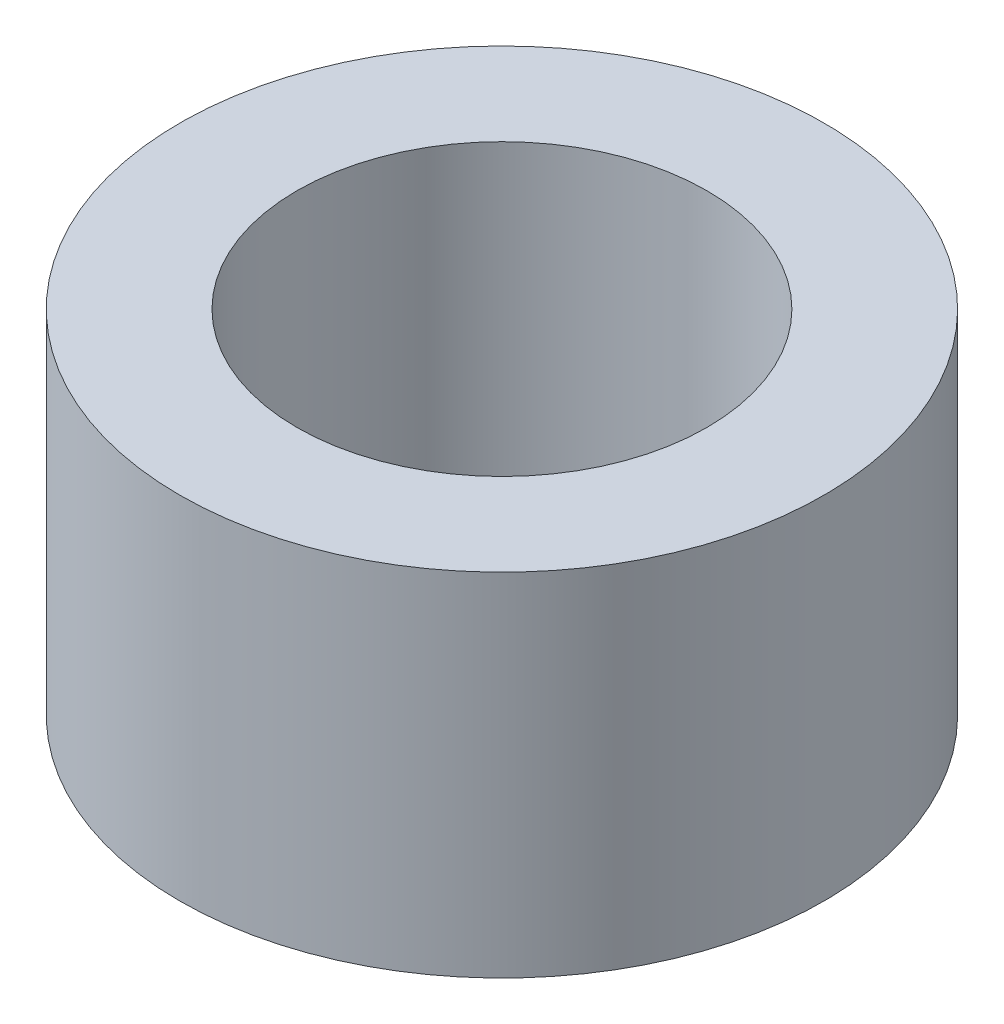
ISO-10303-21;
HEADER;
FILE_DESCRIPTION(('STEP AP214'),'2;1');
FILE_NAME('part.step','',(''),(''),'','','');
FILE_SCHEMA(('AUTOMOTIVE_DESIGN { 1 0 10303 214 1 1 1 1 }'));
ENDSEC;
DATA;
#1=APPLICATION_CONTEXT('core data for automotive mechanical design processes');
#2=APPLICATION_PROTOCOL_DEFINITION('international standard','automotive_design',2000,#1);
#3=PRODUCT_CONTEXT('',#1,'mechanical');
#4=PRODUCT('Part','Part','',(#3));
#5=PRODUCT_RELATED_PRODUCT_CATEGORY('part','',(#4));
#6=PRODUCT_DEFINITION_FORMATION('','',#4);
#7=PRODUCT_DEFINITION_CONTEXT('part definition',#1,'design');
#8=PRODUCT_DEFINITION('design','',#6,#7);
#9=PRODUCT_DEFINITION_SHAPE('','',#8);
#10=(LENGTH_UNIT() NAMED_UNIT(*) SI_UNIT(.MILLI.,.METRE.));
#11=(NAMED_UNIT(*) PLANE_ANGLE_UNIT() SI_UNIT($,.RADIAN.));
#12=(NAMED_UNIT(*) SI_UNIT($,.STERADIAN.) SOLID_ANGLE_UNIT());
#13=UNCERTAINTY_MEASURE_WITH_UNIT(LENGTH_MEASURE(1.E-05),#10,'distance_accuracy_value','');
#14=(GEOMETRIC_REPRESENTATION_CONTEXT(3) GLOBAL_UNCERTAINTY_ASSIGNED_CONTEXT((#13)) GLOBAL_UNIT_ASSIGNED_CONTEXT((#10,
#11,#12)) REPRESENTATION_CONTEXT('',''));
#15=CARTESIAN_POINT('',(0.,0.,0.));
#16=DIRECTION('',(0.,0.,1.));
#17=DIRECTION('',(1.,0.,0.));
#18=AXIS2_PLACEMENT_3D('',#15,#16,#17);
#19=CARTESIAN_POINT('',(0.,3.,0.));
#20=DIRECTION('',(0.,1.,0.));
#21=DIRECTION('',(0.,0.,1.));
#22=AXIS2_PLACEMENT_3D('',#19,#20,#21);
#23=PLANE('',#22);
#24=CARTESIAN_POINT('',(0.,3.,0.));
#25=DIRECTION('',(0.,1.,0.));
#26=DIRECTION('',(0.,0.,1.));
#27=AXIS2_PLACEMENT_3D('',#24,#25,#26);
#28=CIRCLE('',#27,2.75);
#29=CARTESIAN_POINT('',(0.,3.,2.75));
#30=VERTEX_POINT('',#29);
#31=EDGE_CURVE('E10',#30,#30,#28,.T.);
#32=ORIENTED_EDGE('',*,*,#31,.T.);
#33=EDGE_LOOP('',(#32));
#34=FACE_BOUND('',#33,.T.);
#35=CARTESIAN_POINT('',(0.,3.,0.));
#36=DIRECTION('',(0.,1.,0.));
#37=DIRECTION('',(0.,0.,1.));
#38=AXIS2_PLACEMENT_3D('',#35,#36,#37);
#39=CIRCLE('',#38,1.75);
#40=CARTESIAN_POINT('',(0.,3.,1.75));
#41=VERTEX_POINT('',#40);
#42=EDGE_CURVE('E44',#41,#41,#39,.T.);
#43=ORIENTED_EDGE('',*,*,#42,.F.);
#44=EDGE_LOOP('',(#43));
#45=FACE_BOUND('',#44,.T.);
#46=ADVANCED_FACE('F33',(#34,#45),#23,.T.);
#47=CARTESIAN_POINT('',(0.,0.,0.));
#48=DIRECTION('',(0.,1.,0.));
#49=DIRECTION('',(0.,0.,1.));
#50=AXIS2_PLACEMENT_3D('',#47,#48,#49);
#51=PLANE('',#50);
#52=CARTESIAN_POINT('',(0.,0.,0.));
#53=DIRECTION('',(0.,1.,0.));
#54=DIRECTION('',(0.,0.,1.));
#55=AXIS2_PLACEMENT_3D('',#52,#53,#54);
#56=CIRCLE('',#55,2.75);
#57=CARTESIAN_POINT('',(0.,0.,2.75));
#58=VERTEX_POINT('',#57);
#59=EDGE_CURVE('E37',#58,#58,#56,.T.);
#60=ORIENTED_EDGE('',*,*,#59,.F.);
#61=EDGE_LOOP('',(#60));
#62=FACE_BOUND('',#61,.T.);
#63=CARTESIAN_POINT('',(0.,0.,0.));
#64=DIRECTION('',(0.,1.,0.));
#65=DIRECTION('',(0.,0.,1.));
#66=AXIS2_PLACEMENT_3D('',#63,#64,#65);
#67=CIRCLE('',#66,1.75);
#68=CARTESIAN_POINT('',(0.,0.,1.75));
#69=VERTEX_POINT('',#68);
#70=EDGE_CURVE('E46',#69,#69,#67,.T.);
#71=ORIENTED_EDGE('',*,*,#70,.T.);
#72=EDGE_LOOP('',(#71));
#73=FACE_BOUND('',#72,.T.);
#74=ADVANCED_FACE('F56',(#62,#73),#51,.F.);
#75=CARTESIAN_POINT('',(0.,3.,0.));
#76=DIRECTION('',(0.,-1.,0.));
#77=DIRECTION('',(0.,0.,-1.));
#78=AXIS2_PLACEMENT_3D('',#75,#76,#77);
#79=CYLINDRICAL_SURFACE('',#78,2.75);
#80=ORIENTED_EDGE('',*,*,#31,.F.);
#81=EDGE_LOOP('',(#80));
#82=FACE_BOUND('',#81,.T.);
#83=ORIENTED_EDGE('',*,*,#59,.T.);
#84=EDGE_LOOP('',(#83));
#85=FACE_BOUND('',#84,.T.);
#86=ADVANCED_FACE('F35',(#82,#85),#79,.T.);
#87=CARTESIAN_POINT('',(0.,3.,0.));
#88=DIRECTION('',(0.,-1.,0.));
#89=DIRECTION('',(0.,0.,-1.));
#90=AXIS2_PLACEMENT_3D('',#87,#88,#89);
#91=CYLINDRICAL_SURFACE('',#90,1.75);
#92=ORIENTED_EDGE('',*,*,#42,.T.);
#93=EDGE_LOOP('',(#92));
#94=FACE_BOUND('',#93,.T.);
#95=ORIENTED_EDGE('',*,*,#70,.F.);
#96=EDGE_LOOP('',(#95));
#97=FACE_BOUND('',#96,.T.);
#98=ADVANCED_FACE('F52',(#94,#97),#91,.F.);
#99=CLOSED_SHELL('',(#46,#74,#86,#98));
#100=MANIFOLD_SOLID_BREP('B2',#99);
#101=ADVANCED_BREP_SHAPE_REPRESENTATION('',(#18,#100),#14);
#102=SHAPE_DEFINITION_REPRESENTATION(#9,#101);
ENDSEC;
END-ISO-10303-21;
